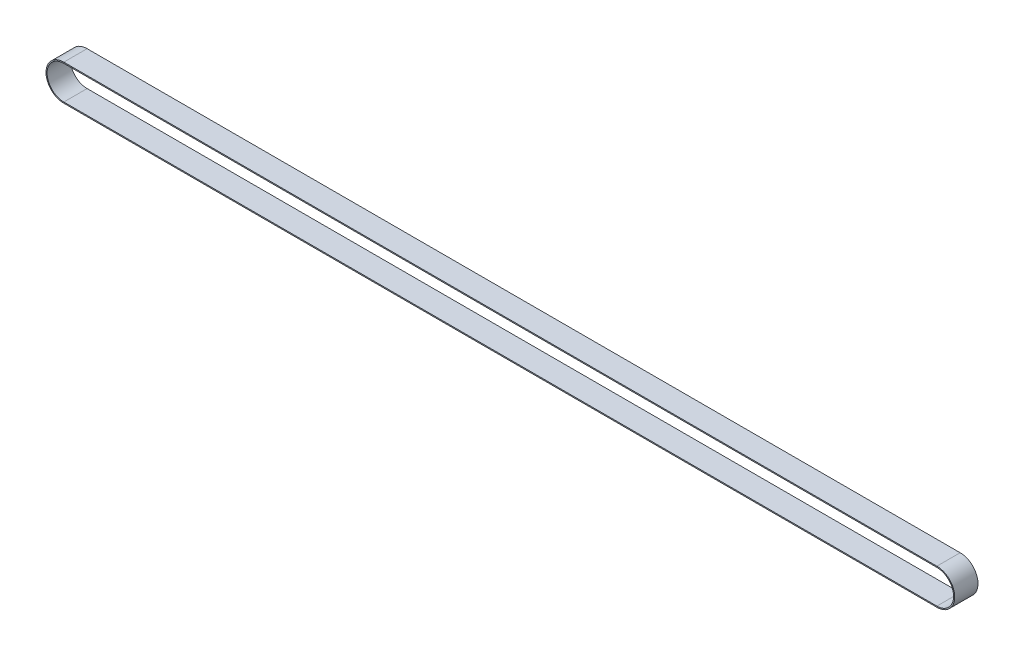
ISO-10303-21;
HEADER;
FILE_DESCRIPTION(('STEP AP214'),'2;1');
FILE_NAME('part.step','',(''),(''),'','','');
FILE_SCHEMA(('AUTOMOTIVE_DESIGN { 1 0 10303 214 1 1 1 1 }'));
ENDSEC;
DATA;
#1=APPLICATION_CONTEXT('core data for automotive mechanical design processes');
#2=APPLICATION_PROTOCOL_DEFINITION('international standard','automotive_design',2000,#1);
#3=PRODUCT_CONTEXT('',#1,'mechanical');
#4=PRODUCT('Part','Part','',(#3));
#5=PRODUCT_RELATED_PRODUCT_CATEGORY('part','',(#4));
#6=PRODUCT_DEFINITION_FORMATION('','',#4);
#7=PRODUCT_DEFINITION_CONTEXT('part definition',#1,'design');
#8=PRODUCT_DEFINITION('design','',#6,#7);
#9=PRODUCT_DEFINITION_SHAPE('','',#8);
#10=(LENGTH_UNIT() NAMED_UNIT(*) SI_UNIT(.MILLI.,.METRE.));
#11=(NAMED_UNIT(*) PLANE_ANGLE_UNIT() SI_UNIT($,.RADIAN.));
#12=(NAMED_UNIT(*) SI_UNIT($,.STERADIAN.) SOLID_ANGLE_UNIT());
#13=UNCERTAINTY_MEASURE_WITH_UNIT(LENGTH_MEASURE(1.E-05),#10,'distance_accuracy_value','');
#14=(GEOMETRIC_REPRESENTATION_CONTEXT(3) GLOBAL_UNCERTAINTY_ASSIGNED_CONTEXT((#13)) GLOBAL_UNIT_ASSIGNED_CONTEXT((#10,
#11,#12)) REPRESENTATION_CONTEXT('',''));
#15=CARTESIAN_POINT('',(0.,0.,0.));
#16=DIRECTION('',(0.,0.,1.));
#17=DIRECTION('',(1.,0.,0.));
#18=AXIS2_PLACEMENT_3D('',#15,#16,#17);
#19=CARTESIAN_POINT('',(1129.5,135.999999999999,16.));
#20=DIRECTION('',(0.,0.,-1.));
#21=DIRECTION('',(-1.,0.,0.));
#22=AXIS2_PLACEMENT_3D('',#19,#20,#21);
#23=PLANE('',#22);
#24=CARTESIAN_POINT('',(1129.5,135.999999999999,16.));
#25=DIRECTION('',(0.,0.,-1.));
#26=DIRECTION('',(-1.,0.,0.));
#27=AXIS2_PLACEMENT_3D('',#24,#25,#26);
#28=CIRCLE('',#27,24.5);
#29=CARTESIAN_POINT('',(1129.5,111.499999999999,16.));
#30=VERTEX_POINT('',#29);
#31=CARTESIAN_POINT('',(1129.5,160.499999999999,16.));
#32=VERTEX_POINT('',#31);
#33=EDGE_CURVE('E175',#30,#32,#28,.F.);
#34=ORIENTED_EDGE('',*,*,#33,.T.);
#35=DIRECTION('',(-1.,0.,0.));
#36=VECTOR('',#35,1.);
#37=CARTESIAN_POINT('',(1129.5,160.499999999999,16.));
#38=LINE('',#37,#36);
#39=CARTESIAN_POINT('',(-70.4999999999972,160.5,16.));
#40=VERTEX_POINT('',#39);
#41=EDGE_CURVE('E178',#32,#40,#38,.T.);
#42=ORIENTED_EDGE('',*,*,#41,.T.);
#43=CARTESIAN_POINT('',(-70.4999999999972,136.,16.));
#44=DIRECTION('',(0.,0.,-1.));
#45=DIRECTION('',(-1.,0.,0.));
#46=AXIS2_PLACEMENT_3D('',#43,#44,#45);
#47=CIRCLE('',#46,24.5);
#48=CARTESIAN_POINT('',(-70.4999999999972,111.5,16.));
#49=VERTEX_POINT('',#48);
#50=EDGE_CURVE('E181',#40,#49,#47,.F.);
#51=ORIENTED_EDGE('',*,*,#50,.T.);
#52=DIRECTION('',(1.,0.,0.));
#53=VECTOR('',#52,1.);
#54=CARTESIAN_POINT('',(1129.5,111.499999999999,16.));
#55=LINE('',#54,#53);
#56=EDGE_CURVE('E183',#49,#30,#55,.T.);
#57=ORIENTED_EDGE('',*,*,#56,.T.);
#58=EDGE_LOOP('',(#34,#42,#51,#57));
#59=FACE_BOUND('',#58,.T.);
#60=CARTESIAN_POINT('',(1129.5,135.999999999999,16.));
#61=DIRECTION('',(0.,0.,1.));
#62=DIRECTION('',(-1.,0.,0.));
#63=AXIS2_PLACEMENT_3D('',#60,#61,#62);
#64=CIRCLE('',#63,23.);
#65=CARTESIAN_POINT('',(1129.5,112.999999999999,16.));
#66=VERTEX_POINT('',#65);
#67=CARTESIAN_POINT('',(1129.5,158.999999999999,16.));
#68=VERTEX_POINT('',#67);
#69=EDGE_CURVE('E134',#66,#68,#64,.T.);
#70=ORIENTED_EDGE('',*,*,#69,.F.);
#71=DIRECTION('',(1.,0.,0.));
#72=VECTOR('',#71,1.);
#73=CARTESIAN_POINT('',(1129.5,112.999999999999,16.));
#74=LINE('',#73,#72);
#75=CARTESIAN_POINT('',(-70.4999999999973,113.,16.));
#76=VERTEX_POINT('',#75);
#77=EDGE_CURVE('E158',#76,#66,#74,.T.);
#78=ORIENTED_EDGE('',*,*,#77,.F.);
#79=CARTESIAN_POINT('',(-70.4999999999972,136.,16.));
#80=DIRECTION('',(0.,0.,1.));
#81=DIRECTION('',(-1.,0.,0.));
#82=AXIS2_PLACEMENT_3D('',#79,#80,#81);
#83=CIRCLE('',#82,23.);
#84=CARTESIAN_POINT('',(-70.4999999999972,159.,16.));
#85=VERTEX_POINT('',#84);
#86=EDGE_CURVE('E154',#85,#76,#83,.T.);
#87=ORIENTED_EDGE('',*,*,#86,.F.);
#88=DIRECTION('',(-1.,0.,0.));
#89=VECTOR('',#88,1.);
#90=CARTESIAN_POINT('',(-70.4999999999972,159.,16.));
#91=LINE('',#90,#89);
#92=EDGE_CURVE('E142',#68,#85,#91,.T.);
#93=ORIENTED_EDGE('',*,*,#92,.F.);
#94=EDGE_LOOP('',(#70,#78,#87,#93));
#95=FACE_BOUND('',#94,.T.);
#96=ADVANCED_FACE('F69',(#59,#95),#23,.F.);
#97=CARTESIAN_POINT('',(1129.5,135.999999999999,-16.));
#98=DIRECTION('',(0.,0.,-1.));
#99=DIRECTION('',(-1.,0.,0.));
#100=AXIS2_PLACEMENT_3D('',#97,#98,#99);
#101=PLANE('',#100);
#102=CARTESIAN_POINT('',(1129.5,135.999999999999,-16.));
#103=DIRECTION('',(0.,0.,-1.));
#104=DIRECTION('',(-1.,0.,0.));
#105=AXIS2_PLACEMENT_3D('',#102,#103,#104);
#106=CIRCLE('',#105,24.5);
#107=CARTESIAN_POINT('',(1129.5,111.499999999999,-16.));
#108=VERTEX_POINT('',#107);
#109=CARTESIAN_POINT('',(1129.5,160.499999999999,-16.));
#110=VERTEX_POINT('',#109);
#111=EDGE_CURVE('E150',#108,#110,#106,.F.);
#112=ORIENTED_EDGE('',*,*,#111,.F.);
#113=DIRECTION('',(1.,0.,0.));
#114=VECTOR('',#113,1.);
#115=CARTESIAN_POINT('',(1129.5,111.499999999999,-16.));
#116=LINE('',#115,#114);
#117=CARTESIAN_POINT('',(-70.4999999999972,111.5,-16.));
#118=VERTEX_POINT('',#117);
#119=EDGE_CURVE('E179',#118,#108,#116,.T.);
#120=ORIENTED_EDGE('',*,*,#119,.F.);
#121=CARTESIAN_POINT('',(-70.4999999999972,136.,-16.));
#122=DIRECTION('',(0.,0.,-1.));
#123=DIRECTION('',(-1.,0.,0.));
#124=AXIS2_PLACEMENT_3D('',#121,#122,#123);
#125=CIRCLE('',#124,24.5);
#126=CARTESIAN_POINT('',(-70.4999999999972,160.5,-16.));
#127=VERTEX_POINT('',#126);
#128=EDGE_CURVE('E192',#127,#118,#125,.F.);
#129=ORIENTED_EDGE('',*,*,#128,.F.);
#130=DIRECTION('',(-1.,0.,0.));
#131=VECTOR('',#130,1.);
#132=CARTESIAN_POINT('',(1129.5,160.499999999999,-16.));
#133=LINE('',#132,#131);
#134=EDGE_CURVE('E189',#110,#127,#133,.T.);
#135=ORIENTED_EDGE('',*,*,#134,.F.);
#136=EDGE_LOOP('',(#112,#120,#129,#135));
#137=FACE_BOUND('',#136,.T.);
#138=DIRECTION('',(1.,0.,0.));
#139=VECTOR('',#138,1.);
#140=CARTESIAN_POINT('',(1129.5,112.999999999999,-16.));
#141=LINE('',#140,#139);
#142=CARTESIAN_POINT('',(-70.4999999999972,113.,-16.));
#143=VERTEX_POINT('',#142);
#144=CARTESIAN_POINT('',(1129.5,112.999999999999,-16.));
#145=VERTEX_POINT('',#144);
#146=EDGE_CURVE('E143',#143,#145,#141,.T.);
#147=ORIENTED_EDGE('',*,*,#146,.T.);
#148=CARTESIAN_POINT('',(1129.5,135.999999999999,-16.));
#149=DIRECTION('',(0.,0.,1.));
#150=DIRECTION('',(-1.,0.,0.));
#151=AXIS2_PLACEMENT_3D('',#148,#149,#150);
#152=CIRCLE('',#151,23.);
#153=CARTESIAN_POINT('',(1129.5,158.999999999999,-16.));
#154=VERTEX_POINT('',#153);
#155=EDGE_CURVE('E92',#145,#154,#152,.T.);
#156=ORIENTED_EDGE('',*,*,#155,.T.);
#157=DIRECTION('',(-1.,0.,0.));
#158=VECTOR('',#157,1.);
#159=CARTESIAN_POINT('',(-70.4999999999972,159.,-16.));
#160=LINE('',#159,#158);
#161=CARTESIAN_POINT('',(-70.4999999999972,159.,-16.));
#162=VERTEX_POINT('',#161);
#163=EDGE_CURVE('E149',#154,#162,#160,.T.);
#164=ORIENTED_EDGE('',*,*,#163,.T.);
#165=CARTESIAN_POINT('',(-70.4999999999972,136.,-16.));
#166=DIRECTION('',(0.,0.,1.));
#167=DIRECTION('',(-1.,0.,0.));
#168=AXIS2_PLACEMENT_3D('',#165,#166,#167);
#169=CIRCLE('',#168,23.);
#170=EDGE_CURVE('E166',#162,#143,#169,.T.);
#171=ORIENTED_EDGE('',*,*,#170,.T.);
#172=EDGE_LOOP('',(#147,#156,#164,#171));
#173=FACE_BOUND('',#172,.T.);
#174=ADVANCED_FACE('F211',(#137,#173),#101,.T.);
#175=CARTESIAN_POINT('',(1129.5,135.999999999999,16.));
#176=DIRECTION('',(0.,0.,-1.));
#177=DIRECTION('',(-1.,0.,0.));
#178=AXIS2_PLACEMENT_3D('',#175,#176,#177);
#179=CYLINDRICAL_SURFACE('',#178,24.5);
#180=ORIENTED_EDGE('',*,*,#111,.T.);
#181=DIRECTION('',(0.,0.,-1.));
#182=VECTOR('',#181,1.);
#183=CARTESIAN_POINT('',(1129.5,160.499999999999,16.));
#184=LINE('',#183,#182);
#185=EDGE_CURVE('E12',#32,#110,#184,.T.);
#186=ORIENTED_EDGE('',*,*,#185,.F.);
#187=ORIENTED_EDGE('',*,*,#33,.F.);
#188=DIRECTION('',(0.,0.,-1.));
#189=VECTOR('',#188,1.);
#190=CARTESIAN_POINT('',(1129.5,111.499999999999,16.));
#191=LINE('',#190,#189);
#192=EDGE_CURVE('E186',#30,#108,#191,.T.);
#193=ORIENTED_EDGE('',*,*,#192,.T.);
#194=EDGE_LOOP('',(#180,#186,#187,#193));
#195=FACE_BOUND('',#194,.T.);
#196=ADVANCED_FACE('F71',(#195),#179,.T.);
#197=CARTESIAN_POINT('',(1129.5,160.499999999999,16.));
#198=DIRECTION('',(0.,-1.,0.));
#199=DIRECTION('',(1.,0.,0.));
#200=AXIS2_PLACEMENT_3D('',#197,#198,#199);
#201=PLANE('',#200);
#202=ORIENTED_EDGE('',*,*,#134,.T.);
#203=DIRECTION('',(0.,0.,-1.));
#204=VECTOR('',#203,1.);
#205=CARTESIAN_POINT('',(-70.4999999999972,160.5,16.));
#206=LINE('',#205,#204);
#207=EDGE_CURVE('E77',#40,#127,#206,.T.);
#208=ORIENTED_EDGE('',*,*,#207,.F.);
#209=ORIENTED_EDGE('',*,*,#41,.F.);
#210=ORIENTED_EDGE('',*,*,#185,.T.);
#211=EDGE_LOOP('',(#202,#208,#209,#210));
#212=FACE_BOUND('',#211,.T.);
#213=ADVANCED_FACE('F221',(#212),#201,.F.);
#214=CARTESIAN_POINT('',(-70.4999999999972,136.,16.));
#215=DIRECTION('',(0.,0.,-1.));
#216=DIRECTION('',(-1.,0.,0.));
#217=AXIS2_PLACEMENT_3D('',#214,#215,#216);
#218=CYLINDRICAL_SURFACE('',#217,24.5);
#219=ORIENTED_EDGE('',*,*,#128,.T.);
#220=DIRECTION('',(0.,0.,-1.));
#221=VECTOR('',#220,1.);
#222=CARTESIAN_POINT('',(-70.4999999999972,111.5,16.));
#223=LINE('',#222,#221);
#224=EDGE_CURVE('E198',#49,#118,#223,.T.);
#225=ORIENTED_EDGE('',*,*,#224,.F.);
#226=ORIENTED_EDGE('',*,*,#50,.F.);
#227=ORIENTED_EDGE('',*,*,#207,.T.);
#228=EDGE_LOOP('',(#219,#225,#226,#227));
#229=FACE_BOUND('',#228,.T.);
#230=ADVANCED_FACE('F205',(#229),#218,.T.);
#231=CARTESIAN_POINT('',(1129.5,111.499999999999,16.));
#232=DIRECTION('',(0.,1.,0.));
#233=DIRECTION('',(-1.,0.,0.));
#234=AXIS2_PLACEMENT_3D('',#231,#232,#233);
#235=PLANE('',#234);
#236=ORIENTED_EDGE('',*,*,#119,.T.);
#237=ORIENTED_EDGE('',*,*,#192,.F.);
#238=ORIENTED_EDGE('',*,*,#56,.F.);
#239=ORIENTED_EDGE('',*,*,#224,.T.);
#240=EDGE_LOOP('',(#236,#237,#238,#239));
#241=FACE_BOUND('',#240,.T.);
#242=ADVANCED_FACE('F215',(#241),#235,.F.);
#243=CARTESIAN_POINT('',(1129.5,135.999999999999,16.));
#244=DIRECTION('',(0.,0.,-1.));
#245=DIRECTION('',(-1.,0.,0.));
#246=AXIS2_PLACEMENT_3D('',#243,#244,#245);
#247=CYLINDRICAL_SURFACE('',#246,23.);
#248=ORIENTED_EDGE('',*,*,#155,.F.);
#249=DIRECTION('',(0.,0.,-1.));
#250=VECTOR('',#249,1.);
#251=CARTESIAN_POINT('',(1129.5,112.999999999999,16.));
#252=LINE('',#251,#250);
#253=EDGE_CURVE('E138',#66,#145,#252,.T.);
#254=ORIENTED_EDGE('',*,*,#253,.F.);
#255=ORIENTED_EDGE('',*,*,#69,.T.);
#256=DIRECTION('',(0.,0.,-1.));
#257=VECTOR('',#256,1.);
#258=CARTESIAN_POINT('',(1129.5,158.999999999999,16.));
#259=LINE('',#258,#257);
#260=EDGE_CURVE('E137',#68,#154,#259,.T.);
#261=ORIENTED_EDGE('',*,*,#260,.T.);
#262=EDGE_LOOP('',(#248,#254,#255,#261));
#263=FACE_BOUND('',#262,.T.);
#264=ADVANCED_FACE('F136',(#263),#247,.F.);
#265=CARTESIAN_POINT('',(-70.4999999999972,159.,16.));
#266=DIRECTION('',(0.,-1.,0.));
#267=DIRECTION('',(1.,0.,0.));
#268=AXIS2_PLACEMENT_3D('',#265,#266,#267);
#269=PLANE('',#268);
#270=ORIENTED_EDGE('',*,*,#163,.F.);
#271=ORIENTED_EDGE('',*,*,#260,.F.);
#272=ORIENTED_EDGE('',*,*,#92,.T.);
#273=DIRECTION('',(0.,0.,-1.));
#274=VECTOR('',#273,1.);
#275=CARTESIAN_POINT('',(-70.4999999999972,159.,16.));
#276=LINE('',#275,#274);
#277=EDGE_CURVE('E151',#85,#162,#276,.T.);
#278=ORIENTED_EDGE('',*,*,#277,.T.);
#279=EDGE_LOOP('',(#270,#271,#272,#278));
#280=FACE_BOUND('',#279,.T.);
#281=ADVANCED_FACE('F146',(#280),#269,.T.);
#282=CARTESIAN_POINT('',(-70.4999999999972,136.,16.));
#283=DIRECTION('',(0.,0.,-1.));
#284=DIRECTION('',(-1.,0.,0.));
#285=AXIS2_PLACEMENT_3D('',#282,#283,#284);
#286=CYLINDRICAL_SURFACE('',#285,23.);
#287=ORIENTED_EDGE('',*,*,#170,.F.);
#288=ORIENTED_EDGE('',*,*,#277,.F.);
#289=ORIENTED_EDGE('',*,*,#86,.T.);
#290=DIRECTION('',(0.,0.,-1.));
#291=VECTOR('',#290,1.);
#292=CARTESIAN_POINT('',(-70.4999999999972,113.,16.));
#293=LINE('',#292,#291);
#294=EDGE_CURVE('E84',#76,#143,#293,.T.);
#295=ORIENTED_EDGE('',*,*,#294,.T.);
#296=EDGE_LOOP('',(#287,#288,#289,#295));
#297=FACE_BOUND('',#296,.T.);
#298=ADVANCED_FACE('F244',(#297),#286,.F.);
#299=CARTESIAN_POINT('',(1129.5,112.999999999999,16.));
#300=DIRECTION('',(0.,1.,0.));
#301=DIRECTION('',(-1.,0.,0.));
#302=AXIS2_PLACEMENT_3D('',#299,#300,#301);
#303=PLANE('',#302);
#304=ORIENTED_EDGE('',*,*,#146,.F.);
#305=ORIENTED_EDGE('',*,*,#294,.F.);
#306=ORIENTED_EDGE('',*,*,#77,.T.);
#307=ORIENTED_EDGE('',*,*,#253,.T.);
#308=EDGE_LOOP('',(#304,#305,#306,#307));
#309=FACE_BOUND('',#308,.T.);
#310=ADVANCED_FACE('F248',(#309),#303,.T.);
#311=CLOSED_SHELL('',(#96,#174,#196,#213,#230,#242,#264,#281,#298,#310));
#312=MANIFOLD_SOLID_BREP('B2',#311);
#313=ADVANCED_BREP_SHAPE_REPRESENTATION('',(#18,#312),#14);
#314=SHAPE_DEFINITION_REPRESENTATION(#9,#313);
ENDSEC;
END-ISO-10303-21;
